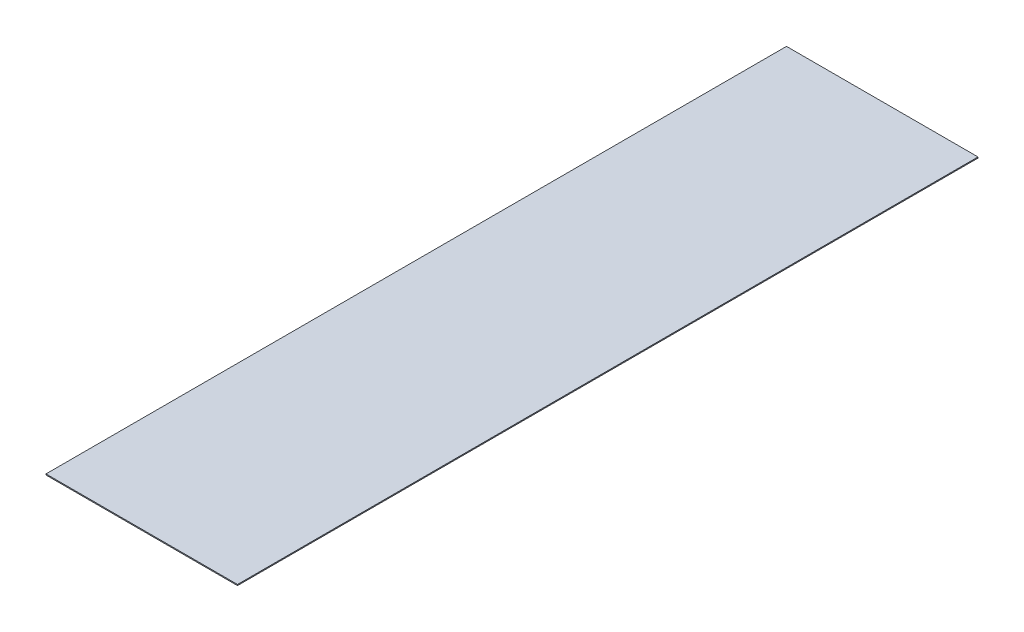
ISO-10303-21;
HEADER;
FILE_DESCRIPTION(('STEP AP214'),'2;1');
FILE_NAME('part.step','',(''),(''),'','','');
FILE_SCHEMA(('AUTOMOTIVE_DESIGN { 1 0 10303 214 1 1 1 1 }'));
ENDSEC;
DATA;
#1=APPLICATION_CONTEXT('core data for automotive mechanical design processes');
#2=APPLICATION_PROTOCOL_DEFINITION('international standard','automotive_design',2000,#1);
#3=PRODUCT_CONTEXT('',#1,'mechanical');
#4=PRODUCT('Part','Part','',(#3));
#5=PRODUCT_RELATED_PRODUCT_CATEGORY('part','',(#4));
#6=PRODUCT_DEFINITION_FORMATION('','',#4);
#7=PRODUCT_DEFINITION_CONTEXT('part definition',#1,'design');
#8=PRODUCT_DEFINITION('design','',#6,#7);
#9=PRODUCT_DEFINITION_SHAPE('','',#8);
#10=(LENGTH_UNIT() NAMED_UNIT(*) SI_UNIT(.MILLI.,.METRE.));
#11=(NAMED_UNIT(*) PLANE_ANGLE_UNIT() SI_UNIT($,.RADIAN.));
#12=(NAMED_UNIT(*) SI_UNIT($,.STERADIAN.) SOLID_ANGLE_UNIT());
#13=UNCERTAINTY_MEASURE_WITH_UNIT(LENGTH_MEASURE(1.E-05),#10,'distance_accuracy_value','');
#14=(GEOMETRIC_REPRESENTATION_CONTEXT(3) GLOBAL_UNCERTAINTY_ASSIGNED_CONTEXT((#13)) GLOBAL_UNIT_ASSIGNED_CONTEXT((#10,
#11,#12)) REPRESENTATION_CONTEXT('',''));
#15=CARTESIAN_POINT('',(0.,0.,0.));
#16=DIRECTION('',(0.,0.,1.));
#17=DIRECTION('',(1.,0.,0.));
#18=AXIS2_PLACEMENT_3D('',#15,#16,#17);
#19=CARTESIAN_POINT('',(0.,0.254,76.2));
#20=DIRECTION('',(0.,0.,-1.));
#21=DIRECTION('',(-1.,0.,0.));
#22=AXIS2_PLACEMENT_3D('',#19,#20,#21);
#23=PLANE('',#22);
#24=DIRECTION('',(1.,0.,0.));
#25=VECTOR('',#24,1.);
#26=CARTESIAN_POINT('',(0.,0.,76.2));
#27=LINE('',#26,#25);
#28=CARTESIAN_POINT('',(19.05,0.,76.2));
#29=VERTEX_POINT('',#28);
#30=CARTESIAN_POINT('',(66.675,0.,76.2));
#31=VERTEX_POINT('',#30);
#32=EDGE_CURVE('E98',#29,#31,#27,.T.);
#33=ORIENTED_EDGE('',*,*,#32,.T.);
#34=DIRECTION('',(0.,-1.,0.));
#35=VECTOR('',#34,1.);
#36=CARTESIAN_POINT('',(66.675,0.254,76.2));
#37=LINE('',#36,#35);
#38=CARTESIAN_POINT('',(66.675,0.254,76.2));
#39=VERTEX_POINT('',#38);
#40=EDGE_CURVE('E11',#39,#31,#37,.T.);
#41=ORIENTED_EDGE('',*,*,#40,.F.);
#42=DIRECTION('',(1.,0.,0.));
#43=VECTOR('',#42,1.);
#44=CARTESIAN_POINT('',(0.,0.254,76.2));
#45=LINE('',#44,#43);
#46=CARTESIAN_POINT('',(19.05,0.254,76.2));
#47=VERTEX_POINT('',#46);
#48=EDGE_CURVE('E84',#47,#39,#45,.T.);
#49=ORIENTED_EDGE('',*,*,#48,.F.);
#50=DIRECTION('',(0.,-1.,0.));
#51=VECTOR('',#50,1.);
#52=CARTESIAN_POINT('',(19.05,0.254,76.2));
#53=LINE('',#52,#51);
#54=EDGE_CURVE('E51',#47,#29,#53,.T.);
#55=ORIENTED_EDGE('',*,*,#54,.T.);
#56=EDGE_LOOP('',(#33,#41,#49,#55));
#57=FACE_BOUND('',#56,.T.);
#58=ADVANCED_FACE('F35',(#57),#23,.F.);
#59=CARTESIAN_POINT('',(66.675,0.254,0.));
#60=DIRECTION('',(-1.,0.,0.));
#61=DIRECTION('',(0.,0.,1.));
#62=AXIS2_PLACEMENT_3D('',#59,#60,#61);
#63=PLANE('',#62);
#64=DIRECTION('',(0.,0.,-1.));
#65=VECTOR('',#64,1.);
#66=CARTESIAN_POINT('',(66.675,0.,0.));
#67=LINE('',#66,#65);
#68=CARTESIAN_POINT('',(66.675,0.,-107.95));
#69=VERTEX_POINT('',#68);
#70=EDGE_CURVE('E89',#31,#69,#67,.T.);
#71=ORIENTED_EDGE('',*,*,#70,.T.);
#72=DIRECTION('',(0.,-1.,0.));
#73=VECTOR('',#72,1.);
#74=CARTESIAN_POINT('',(66.675,0.254,-107.95));
#75=LINE('',#74,#73);
#76=CARTESIAN_POINT('',(66.675,0.254,-107.95));
#77=VERTEX_POINT('',#76);
#78=EDGE_CURVE('E43',#77,#69,#75,.T.);
#79=ORIENTED_EDGE('',*,*,#78,.F.);
#80=DIRECTION('',(0.,0.,-1.));
#81=VECTOR('',#80,1.);
#82=CARTESIAN_POINT('',(66.675,0.254,0.));
#83=LINE('',#82,#81);
#84=EDGE_CURVE('E76',#39,#77,#83,.T.);
#85=ORIENTED_EDGE('',*,*,#84,.F.);
#86=ORIENTED_EDGE('',*,*,#40,.T.);
#87=EDGE_LOOP('',(#71,#79,#85,#86));
#88=FACE_BOUND('',#87,.T.);
#89=ADVANCED_FACE('F88',(#88),#63,.F.);
#90=CARTESIAN_POINT('',(0.,0.254,-107.95));
#91=DIRECTION('',(0.,0.,-1.));
#92=DIRECTION('',(-1.,0.,0.));
#93=AXIS2_PLACEMENT_3D('',#90,#91,#92);
#94=PLANE('',#93);
#95=DIRECTION('',(1.,0.,0.));
#96=VECTOR('',#95,1.);
#97=CARTESIAN_POINT('',(0.,0.,-107.95));
#98=LINE('',#97,#96);
#99=CARTESIAN_POINT('',(19.05,0.,-107.95));
#100=VERTEX_POINT('',#99);
#101=EDGE_CURVE('E101',#100,#69,#98,.T.);
#102=ORIENTED_EDGE('',*,*,#101,.F.);
#103=DIRECTION('',(0.,-1.,0.));
#104=VECTOR('',#103,1.);
#105=CARTESIAN_POINT('',(19.05,0.254,-107.95));
#106=LINE('',#105,#104);
#107=CARTESIAN_POINT('',(19.05,0.254,-107.95));
#108=VERTEX_POINT('',#107);
#109=EDGE_CURVE('E65',#108,#100,#106,.T.);
#110=ORIENTED_EDGE('',*,*,#109,.F.);
#111=DIRECTION('',(1.,0.,0.));
#112=VECTOR('',#111,1.);
#113=CARTESIAN_POINT('',(0.,0.254,-107.95));
#114=LINE('',#113,#112);
#115=EDGE_CURVE('E83',#108,#77,#114,.T.);
#116=ORIENTED_EDGE('',*,*,#115,.T.);
#117=ORIENTED_EDGE('',*,*,#78,.T.);
#118=EDGE_LOOP('',(#102,#110,#116,#117));
#119=FACE_BOUND('',#118,.T.);
#120=ADVANCED_FACE('F92',(#119),#94,.T.);
#121=CARTESIAN_POINT('',(19.05,0.254,0.));
#122=DIRECTION('',(-1.,0.,0.));
#123=DIRECTION('',(0.,0.,1.));
#124=AXIS2_PLACEMENT_3D('',#121,#122,#123);
#125=PLANE('',#124);
#126=DIRECTION('',(0.,0.,-1.));
#127=VECTOR('',#126,1.);
#128=CARTESIAN_POINT('',(19.05,0.,0.));
#129=LINE('',#128,#127);
#130=EDGE_CURVE('E103',#29,#100,#129,.T.);
#131=ORIENTED_EDGE('',*,*,#130,.F.);
#132=ORIENTED_EDGE('',*,*,#54,.F.);
#133=DIRECTION('',(0.,0.,-1.));
#134=VECTOR('',#133,1.);
#135=CARTESIAN_POINT('',(19.05,0.254,0.));
#136=LINE('',#135,#134);
#137=EDGE_CURVE('E93',#47,#108,#136,.T.);
#138=ORIENTED_EDGE('',*,*,#137,.T.);
#139=ORIENTED_EDGE('',*,*,#109,.T.);
#140=EDGE_LOOP('',(#131,#132,#138,#139));
#141=FACE_BOUND('',#140,.T.);
#142=ADVANCED_FACE('F109',(#141),#125,.T.);
#143=CARTESIAN_POINT('',(0.,0.254,0.));
#144=DIRECTION('',(0.,1.,0.));
#145=DIRECTION('',(0.,0.,1.));
#146=AXIS2_PLACEMENT_3D('',#143,#144,#145);
#147=PLANE('',#146);
#148=ORIENTED_EDGE('',*,*,#48,.T.);
#149=ORIENTED_EDGE('',*,*,#84,.T.);
#150=ORIENTED_EDGE('',*,*,#115,.F.);
#151=ORIENTED_EDGE('',*,*,#137,.F.);
#152=EDGE_LOOP('',(#148,#149,#150,#151));
#153=FACE_BOUND('',#152,.T.);
#154=ADVANCED_FACE('F80',(#153),#147,.T.);
#155=CARTESIAN_POINT('',(0.,0.,0.));
#156=DIRECTION('',(0.,1.,0.));
#157=DIRECTION('',(0.,0.,1.));
#158=AXIS2_PLACEMENT_3D('',#155,#156,#157);
#159=PLANE('',#158);
#160=ORIENTED_EDGE('',*,*,#32,.F.);
#161=ORIENTED_EDGE('',*,*,#130,.T.);
#162=ORIENTED_EDGE('',*,*,#101,.T.);
#163=ORIENTED_EDGE('',*,*,#70,.F.);
#164=EDGE_LOOP('',(#160,#161,#162,#163));
#165=FACE_BOUND('',#164,.T.);
#166=ADVANCED_FACE('F108',(#165),#159,.F.);
#167=CLOSED_SHELL('',(#58,#89,#120,#142,#154,#166));
#168=MANIFOLD_SOLID_BREP('B2',#167);
#169=ADVANCED_BREP_SHAPE_REPRESENTATION('',(#18,#168),#14);
#170=SHAPE_DEFINITION_REPRESENTATION(#9,#169);
ENDSEC;
END-ISO-10303-21;
